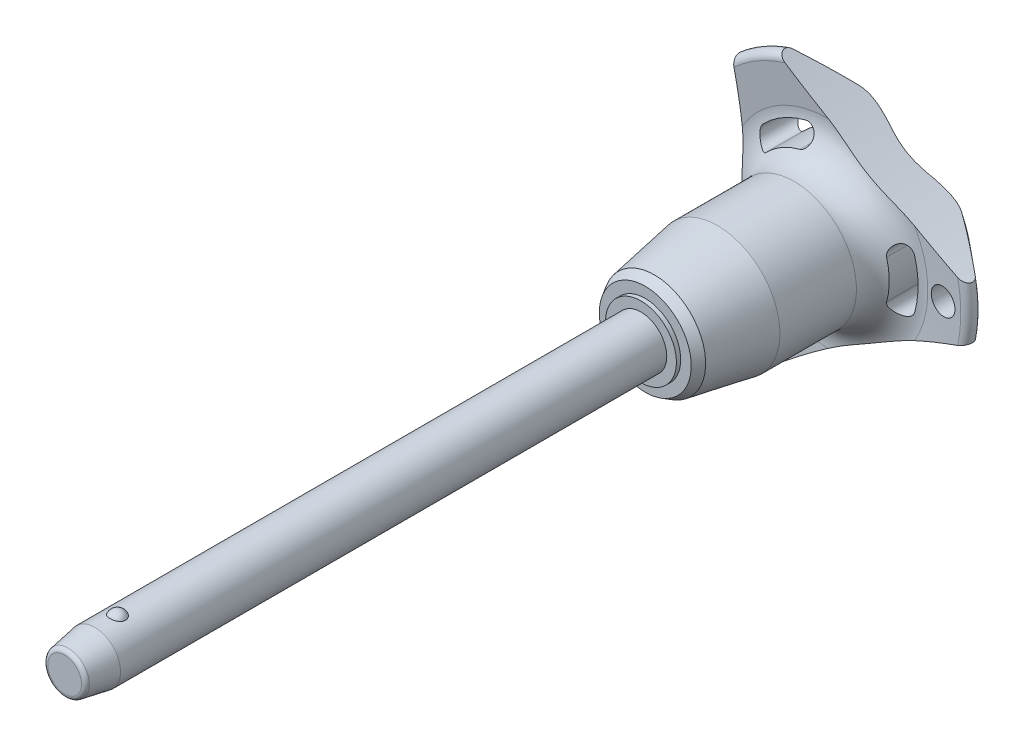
from build123d import *

# Parameters (mm, degrees)
SKETCH1_R           = 3
BOSS_EXTRUDE1_DEPTH = 60
SKETCH2_R           = 2.5
BOSS_EXTRUDE2_DEPTH = 26.7
BOSS_EXTRUDE3_START = 7
SKETCH1_2_R         = 3
BOSS_EXTRUDE3_DEPTH = 7
CHAMFER1_SIZE       = 3.5
CHAMFER1_SIZE2      = 0.617144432
FILLET1_R           = 0.5
SKETCH6_R           = 79.96
CUT_EXTRUDE1_DEPTH  = 90.822819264
CIRPATTERN1_COUNT   = 3
SKETCH7_R           = 1.5
CUT_EXTRUDE2_DEPTH  = 90.653203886


with BuildPart() as part:
    # Sketch1 → Boss-Extrude1 (new body)
    with BuildSketch(Plane.XY):
        Circle(SKETCH1_R)
    extrude(amount=-BOSS_EXTRUDE1_DEPTH)

    # Sketch2 → Boss-Extrude2 (add)
    with BuildSketch(Plane(origin=(0, 0, -60), x_dir=(-1, 0, 0), z_dir=(0, 0, -1))):
        Circle(SKETCH2_R)
    extrude(amount=BOSS_EXTRUDE2_DEPTH)

    # Sketch3 → Revolve1 (revolve)
    with BuildSketch(Plane(origin=(0, 0, 0), x_dir=(0, 0, -1), z_dir=(1, 0, 0))):
        with BuildLine():
            Line((-0.866025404, 3.5), (-0.866025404, 1.5))
            ThreePointArc((-0.866025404, 1.5), (0.133974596, 2.5), (-0.866025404, 3.5))
        make_face()
        with BuildLine():
            Line((-0.866025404, -1.5), (-0.866025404, -3.5))
            ThreePointArc((-0.866025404, -3.5), (0.133974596, -2.5), (-0.866025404, -1.5))
        make_face()
    revolve(axis=Axis((0, -1.5, 0.866025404), (0, 1, 0)))

    # Sketch1_2 → Boss-Extrude3 (add)
    with BuildSketch(Plane.XY.offset(BOSS_EXTRUDE3_START)):
        Circle(SKETCH1_2_R)
    extrude(amount=-BOSS_EXTRUDE3_DEPTH)

    # Chamfer1
    chamfer1_edges = [part.edges().sort_by_distance(p)[0] for p in [
        (-3, 0, 7),
    ]]
    chamfer1_side = [part.faces().sort_by_distance(p)[0] for p in [
        (-3, 0, -26.5),
    ]]
    chamfer(chamfer1_edges, length=CHAMFER1_SIZE, length2=CHAMFER1_SIZE2, reference=chamfer1_side[0])

    # Fillet1
    fillet1_edges = [part.edges().sort_by_distance(p)[0] for p in [
        (-2.382855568, 0, 7),
        (2.5, 0, -86.7),
    ]]
    fillet(fillet1_edges, radius=FILLET1_R)

    # Sketch4 → Revolve2 (revolve)
    with BuildSketch(Plane(origin=(0, 0, 0), x_dir=(0, 0, -1), z_dir=(1, 0, 0)), mode=Mode.PRIVATE) as revolve2_sk:
        Polygon((60, 0), (60, 4.118359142), (60.5, 4.118359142), (60.5, 5.343400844), (61.560917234, 5.955921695), (68.9, 7.25), (77.8, 7.25), (77.8, 0), align=None)
    revolve(revolve2_sk.sketch.rotate(Axis((0, 0, -77.8), (0, 0, 1)), 90), axis=Axis((0, 0, -77.8), (0, 0, 1)))

    # Sketch5 → Revolve3 (revolve)
    with BuildSketch(Plane(origin=(0, 0, 0), x_dir=(0, 0, -1), z_dir=(1, 0, 0)), mode=Mode.PRIVATE) as revolve3_sk:
        with BuildLine():
            Line((81.78715932, 11.570250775), (81.452568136, 15.735949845))
            ThreePointArc((81.452568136, 15.735949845), (81.946485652, 16.540188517), (82.862835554, 16.314230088))
            Line((82.862835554, 16.314230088), (86.326414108, 12.186497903))
            ThreePointArc((86.326414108, 12.186497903), (86.7, 11.109282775), (86.261488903, 10.056825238))
            ThreePointArc((86.261488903, 10.056825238), (83.289873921, 5.413681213), (82.25, 0))
            Line((82.25, 0), (77.8, 0))
            Line((77.8, 0), (77.8, 7.25))
            ThreePointArc((77.8, 7.25), (80.739473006, 8.537160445), (81.78715932, 11.570250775))
        make_face()
    revolve(revolve3_sk.sketch.rotate(Axis((0, 0, -82.25), (0, 0, 1)), 90), axis=Axis((0, 0, -82.25), (0, 0, 1)))

    # Sketch6 → Cut-Extrude1 (cut, through all)
    with BuildSketch(Plane.XY):
        with Locations((-89.76, 0)):
            Circle(SKETCH6_R)
        with BuildLine():
            ThreePointArc((10.099921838, -2.834717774), (10.490188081, 0), (10.099921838, 2.834717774))
            ThreePointArc((10.099921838, 2.834717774), (8.768180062, 3.582738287), (8.020159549, 2.250996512))
            ThreePointArc((8.020159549, 2.250996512), (8.330062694, 0), (8.020159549, -2.250996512))
            ThreePointArc((8.020159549, -2.250996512), (8.768180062, -3.582738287), (10.099921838, -2.834717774))
        make_face()
    cut_extrude1 = extrude(amount=-CUT_EXTRUDE1_DEPTH, mode=Mode.SUBTRACT)

    # CirPattern1: Cut-Extrude1 ×3 about axis
    cirpattern1_axis = Axis((0, 0, 0), (0, 0, 1))
    for i in range(1, CIRPATTERN1_COUNT):
        add(cut_extrude1.rotate(cirpattern1_axis, i * 360 / CIRPATTERN1_COUNT), mode=Mode.SUBTRACT)

    # Sketch7 → Cut-Extrude2 (cut, through all)
    with BuildSketch(Plane.XY):
        with Locations(Location((13.490188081, 0, 0), (0, 0, 225.221865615))):
            Circle(SKETCH7_R)
    extrude(amount=-CUT_EXTRUDE2_DEPTH, mode=Mode.SUBTRACT)


solid = part.part
